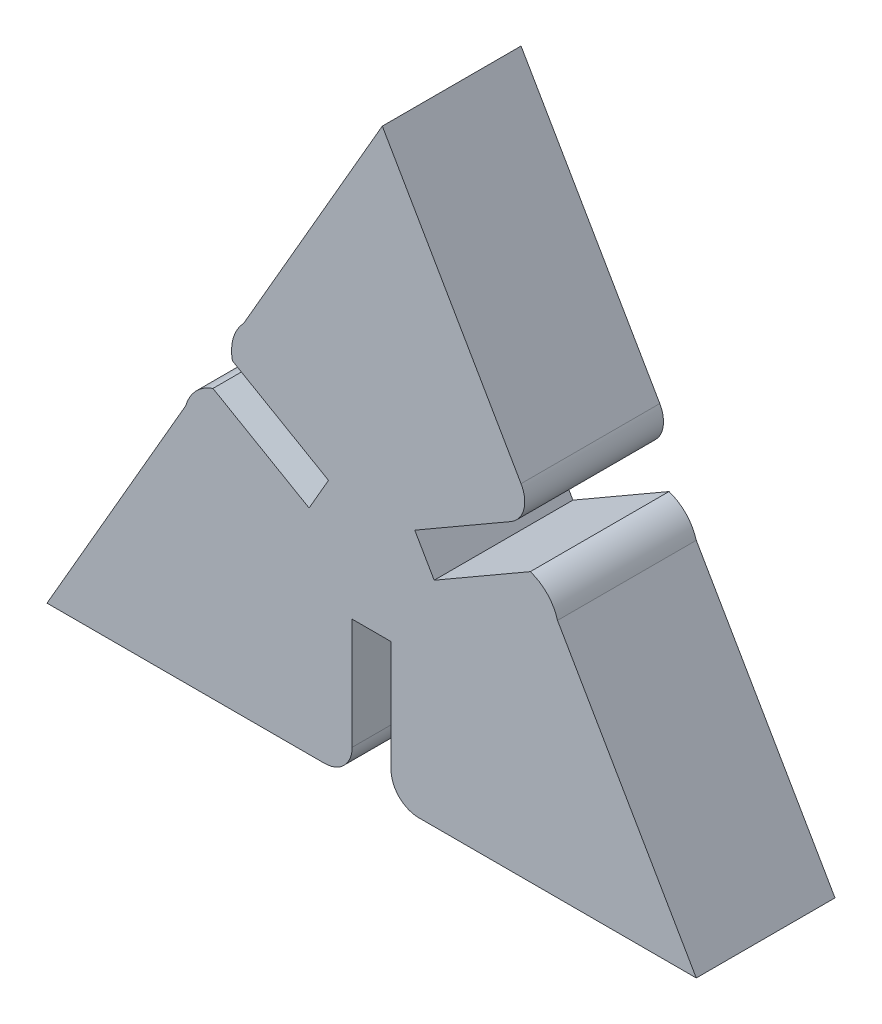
from build123d import *

# Parameters (mm, degrees)
BOSS_EXTRUDE3_DEPTH = 10


with BuildPart() as part:
    # Sketch1 → Boss-Extrude3 (new body)
    with BuildSketch(Plane.XY):
        with BuildLine():
            Line((-13.4, -9.545047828), (-23.4, -26.865555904))
            Line((-23.4, -26.865555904), (-3.4, -26.865555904))
            ThreePointArc((-3.4, -26.865555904), (-1.985786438, -26.279769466), (-1.4, -24.865555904))
            Line((-1.4, -24.865555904), (-1.4, -16.865555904))
            Line((-1.4, -16.865555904), (1.4, -16.865555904))
            Line((1.4, -16.865555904), (1.4, -24.865555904))
            ThreePointArc((1.4, -24.865555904), (1.985786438, -26.279769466), (3.4, -26.865555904))
            Line((3.4, -26.865555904), (23.4, -26.865555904))
            Line((23.4, -26.865555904), (13.4, -9.545047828))
            ThreePointArc((13.4, -9.545047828), (12.674641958, -8.269386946), (11.437324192, -7.48040043))
            Line((11.437324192, -7.48040043), (4.509120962, -11.48040043))
            Line((4.509120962, -11.48040043), (3.109120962, -9.0555293))
            Line((3.109120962, -9.0555293), (10.037324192, -5.0555293))
            ThreePointArc((10.037324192, -5.0555293), (10.969175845, -3.841116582), (10.769375, -2.323478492))
            Line((10.769375, -2.323478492), (0.769375, 14.997029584))
            Line((0.769375, 14.997029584), (-9.230625, -2.323478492))
            ThreePointArc((-9.230625, -2.323478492), (-9.972700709, -3.589487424), (-10.037324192, -5.0555293))
            Line((-10.037324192, -5.0555293), (-3.109120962, -9.0555293))
            Line((-3.109120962, -9.0555293), (-4.509120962, -11.48040043))
            Line((-4.509120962, -11.48040043), (-11.437324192, -7.48040043))
            ThreePointArc((-11.437324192, -7.48040043), (-12.674641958, -8.269386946), (-13.4, -9.545047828))
        make_face()
    extrude(amount=BOSS_EXTRUDE3_DEPTH)


solid = part.part
